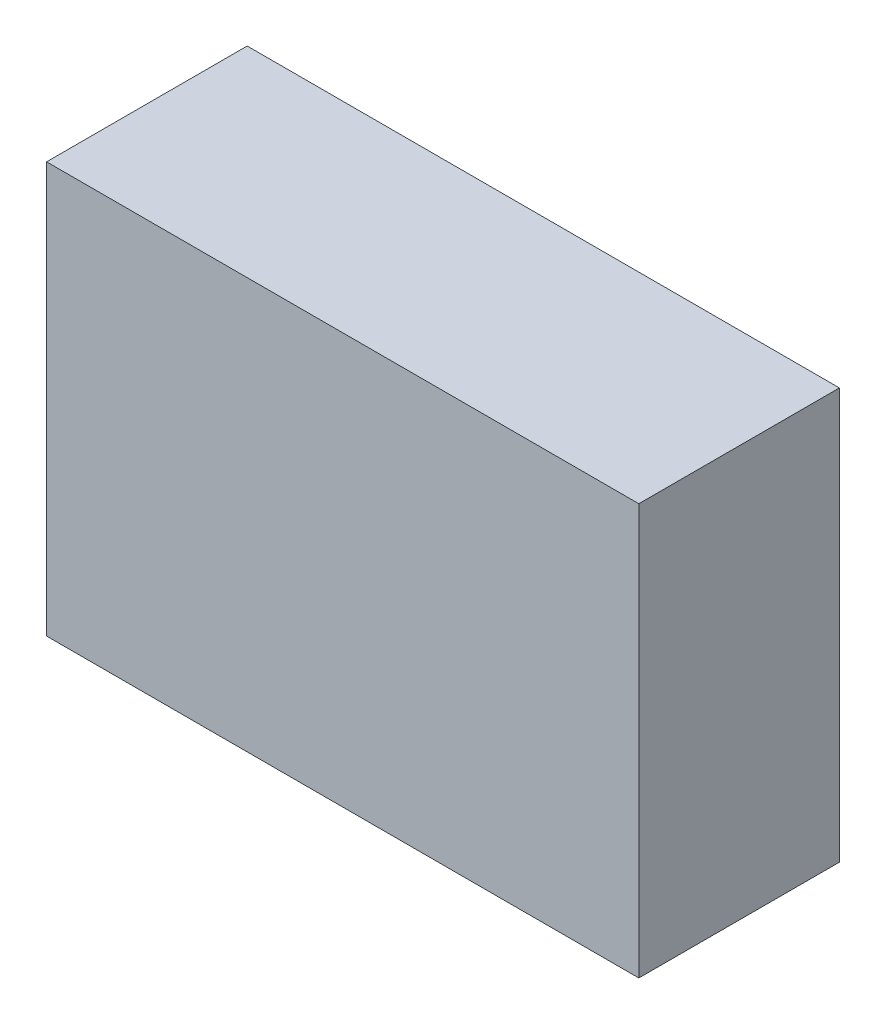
from build123d import *

# Parameters (mm, degrees)
SKETCH1_W           = 62
SKETCH1_H           = 43
BOSS_EXTRUDE1_DEPTH = 21


with BuildPart() as part:
    # Sketch1 → Boss-Extrude1 (new body)
    with BuildSketch(Plane.XY):
        Rectangle(SKETCH1_W, SKETCH1_H)
    extrude(amount=BOSS_EXTRUDE1_DEPTH)


solid = part.part
